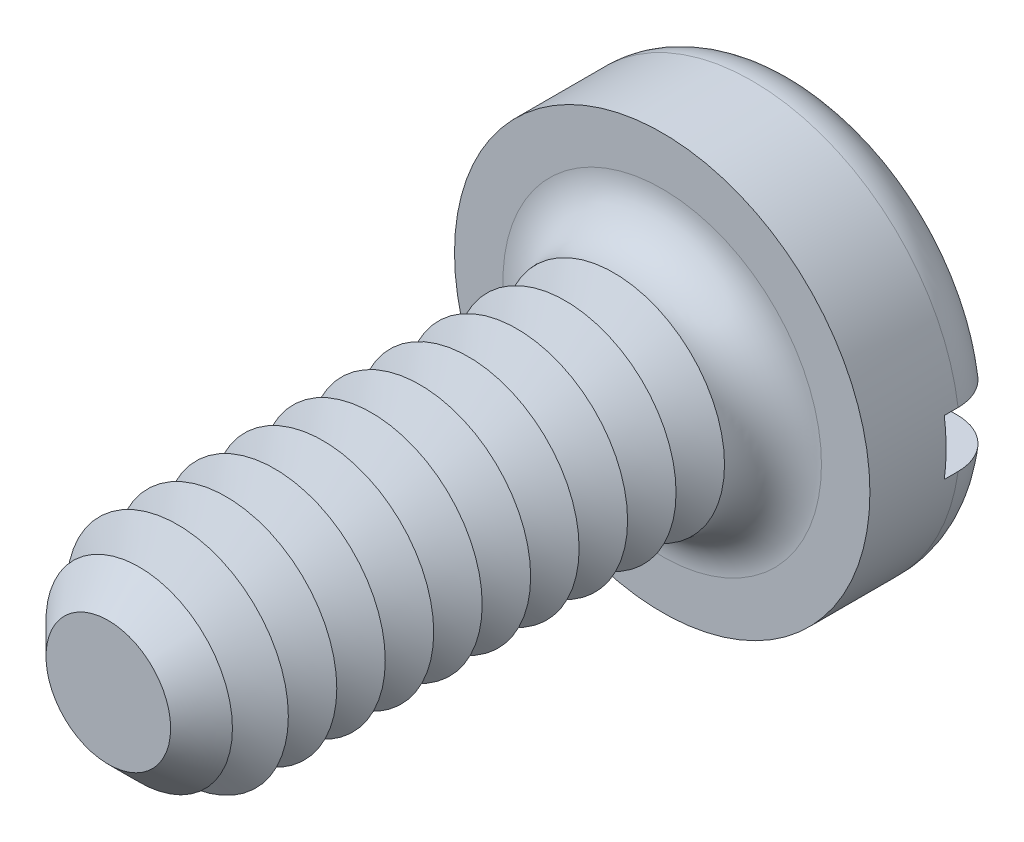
from build123d import *

# Parameters (mm, degrees)
SKETCH3_R           = 1.5
BOSS_EXTRUDE2_DEPTH = 1
SKETCH4_R           = 0.8
BOSS_EXTRUDE3_DEPTH = 4
FILLET1_R           = 0.35
CHAMFER1_SIZE       = 0.35
LPATTERN1_COUNT     = 10
LPATTERN1_PITCH     = 0.35
SKETCH8_W           = 3
SKETCH8_H           = 0.4
CUT_EXTRUDE1_DEPTH  = 0.45


with BuildPart() as part:
    # Sketch3 → Boss-Extrude2 (new body)
    with BuildSketch(Plane.XY):
        Circle(SKETCH3_R)
    extrude(amount=-BOSS_EXTRUDE2_DEPTH)

    # Sketch4 → Boss-Extrude3 (add)
    with BuildSketch(Plane.XY):
        Circle(SKETCH4_R)
    extrude(amount=BOSS_EXTRUDE3_DEPTH)

    # Fillet1
    fillet1_edges = [part.edges().sort_by_distance(p)[0] for p in [
        (-1.5, 0, -1),
        (-0.8, 0, 0),
    ]]
    fillet(fillet1_edges, radius=FILLET1_R)

    # Chamfer1
    chamfer1_edges = [part.edges().sort_by_distance(p)[0] for p in [
        (-0.8, 0, 4),
    ]]
    chamfer(chamfer1_edges, length=CHAMFER1_SIZE)

    # Sketch6 → Cut-Revolve1 (revolve, cut)
    with BuildSketch(Plane(origin=(0, 0, 0), x_dir=(0, 0, -1), z_dir=(1, 0, 0)), mode=Mode.PRIVATE) as cut_revolve1_sk:
        Polygon((-0.35, 0.8), (-0.525, 0.496891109), (-0.7, 0.8), align=None)
    cut_revolve1 = revolve(cut_revolve1_sk.sketch.rotate(Axis((0, 0, -1.694361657), (0, 0, 1)), 90), axis=Axis((0, 0, -1.694361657), (0, 0, 1)), mode=Mode.SUBTRACT)

    # LPattern1: Cut-Revolve1 ×10
    with Locations(*[(0, 0, i * LPATTERN1_PITCH) for i in range(1, LPATTERN1_COUNT)]):
        add(cut_revolve1, mode=Mode.SUBTRACT)

    # Sketch8 → Cut-Extrude1 (cut)
    with BuildSketch(Plane(origin=(0, 0, -1), x_dir=(-1, 0, 0), z_dir=(0, 0, -1))):
        Rectangle(SKETCH8_W, SKETCH8_H)
    extrude(amount=-CUT_EXTRUDE1_DEPTH, mode=Mode.SUBTRACT)


solid = part.part
